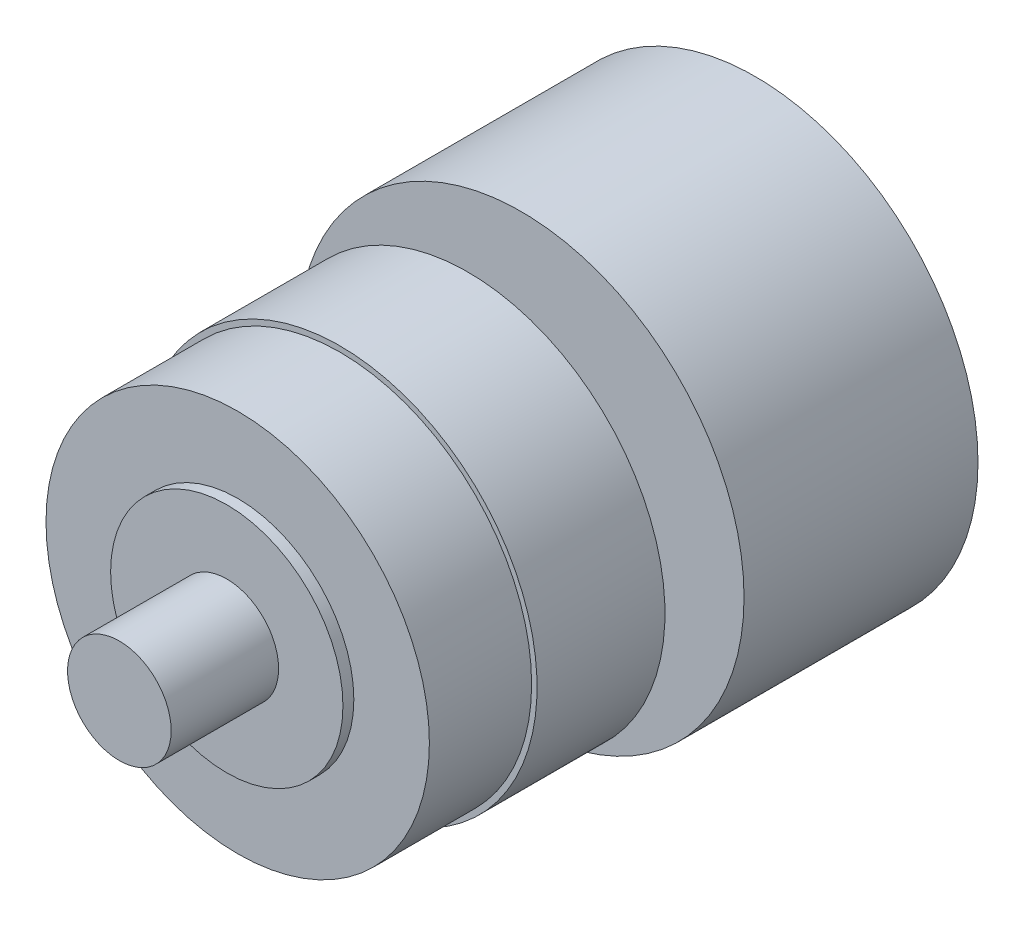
ISO-10303-21;
HEADER;
FILE_DESCRIPTION(('STEP AP214'),'2;1');
FILE_NAME('part.step','',(''),(''),'','','');
FILE_SCHEMA(('AUTOMOTIVE_DESIGN { 1 0 10303 214 1 1 1 1 }'));
ENDSEC;
DATA;
#1=APPLICATION_CONTEXT('core data for automotive mechanical design processes');
#2=APPLICATION_PROTOCOL_DEFINITION('international standard','automotive_design',2000,#1);
#3=PRODUCT_CONTEXT('',#1,'mechanical');
#4=PRODUCT('Part','Part','',(#3));
#5=PRODUCT_RELATED_PRODUCT_CATEGORY('part','',(#4));
#6=PRODUCT_DEFINITION_FORMATION('','',#4);
#7=PRODUCT_DEFINITION_CONTEXT('part definition',#1,'design');
#8=PRODUCT_DEFINITION('design','',#6,#7);
#9=PRODUCT_DEFINITION_SHAPE('','',#8);
#10=(LENGTH_UNIT() NAMED_UNIT(*) SI_UNIT(.MILLI.,.METRE.));
#11=(NAMED_UNIT(*) PLANE_ANGLE_UNIT() SI_UNIT($,.RADIAN.));
#12=(NAMED_UNIT(*) SI_UNIT($,.STERADIAN.) SOLID_ANGLE_UNIT());
#13=UNCERTAINTY_MEASURE_WITH_UNIT(LENGTH_MEASURE(1.E-05),#10,'distance_accuracy_value','');
#14=(GEOMETRIC_REPRESENTATION_CONTEXT(3) GLOBAL_UNCERTAINTY_ASSIGNED_CONTEXT((#13)) GLOBAL_UNIT_ASSIGNED_CONTEXT((#10,
#11,#12)) REPRESENTATION_CONTEXT('',''));
#15=CARTESIAN_POINT('',(0.,0.,0.));
#16=DIRECTION('',(0.,0.,1.));
#17=DIRECTION('',(1.,0.,0.));
#18=AXIS2_PLACEMENT_3D('',#15,#16,#17);
#19=CARTESIAN_POINT('',(-3.66617420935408,-6.34999999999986,-31.2674));
#20=DIRECTION('',(0.866025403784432,0.500000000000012,0.));
#21=DIRECTION('',(-0.500000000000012,0.866025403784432,0.));
#22=AXIS2_PLACEMENT_3D('',#19,#20,#21);
#23=PLANE('',#22);
#24=CARTESIAN_POINT('',(-3.66605873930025,-6.35019999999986,-30.2722361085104));
#25=CARTESIAN_POINT('',(-3.72909602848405,-6.24101621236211,-30.3352669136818));
#26=CARTESIAN_POINT('',(-3.79261785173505,-6.13099318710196,-30.3963633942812));
#27=CARTESIAN_POINT('',(-3.92072562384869,-5.90910401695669,-30.5140992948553));
#28=CARTESIAN_POINT('',(-3.98531213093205,-5.79723690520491,-30.5707362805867));
#29=CARTESIAN_POINT('',(-4.18141127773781,-5.45758321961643,-30.7335583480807));
#30=CARTESIAN_POINT('',(-4.31458398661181,-5.22692132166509,-30.8319599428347));
#31=CARTESIAN_POINT('',(-4.58313739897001,-4.76177316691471,-31.000465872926));
#32=CARTESIAN_POINT('',(-4.71844946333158,-4.52740579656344,-31.0709947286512));
#33=CARTESIAN_POINT('',(-4.92364212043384,-4.17200168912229,-31.1525792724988));
#34=CARTESIAN_POINT('',(-4.99234176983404,-4.05301040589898,-31.1757284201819));
#35=CARTESIAN_POINT('',(-5.13032275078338,-3.81402033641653,-31.2134332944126));
#36=CARTESIAN_POINT('',(-5.19960399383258,-3.6940217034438,-31.2279903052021));
#37=CARTESIAN_POINT('',(-5.36843302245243,-3.40160124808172,-31.2523972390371));
#38=CARTESIAN_POINT('',(-5.46816271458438,-3.22886435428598,-31.2575182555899));
#39=CARTESIAN_POINT('',(-5.6674423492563,-2.88370190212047,-31.2489227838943));
#40=CARTESIAN_POINT('',(-5.76699221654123,-2.71127647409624,-31.2351996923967));
#41=CARTESIAN_POINT('',(-5.96515340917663,-2.36805122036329,-31.1897249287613));
#42=CARTESIAN_POINT('',(-6.06376355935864,-2.19725343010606,-31.1579530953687));
#43=CARTESIAN_POINT('',(-6.25928899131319,-1.85859344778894,-31.0781081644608));
#44=CARTESIAN_POINT('',(-6.35620440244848,-1.69073103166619,-31.0300363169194));
#45=CARTESIAN_POINT('',(-6.52824622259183,-1.3927458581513,-30.9311380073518));
#46=CARTESIAN_POINT('',(-6.60375359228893,-1.26196325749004,-30.8829125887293));
#47=CARTESIAN_POINT('',(-6.75341289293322,-1.00274574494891,-30.7786904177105));
#48=CARTESIAN_POINT('',(-6.82756478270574,-0.874310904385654,-30.7226934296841));
#49=CARTESIAN_POINT('',(-6.97427956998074,-0.620193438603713,-30.6041833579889));
#50=CARTESIAN_POINT('',(-7.04684664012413,-0.494503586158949,-30.5416907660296));
#51=CARTESIAN_POINT('',(-7.19063704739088,-0.245451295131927,-30.4110099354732));
#52=CARTESIAN_POINT('',(-7.26186117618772,-0.122087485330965,-30.3428251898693));
#53=CARTESIAN_POINT('',(-7.33246388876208,0.000200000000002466,-30.2722361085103));
#54=B_SPLINE_CURVE_WITH_KNOTS('',3,(#24,#25,#26,#27,#28,#29,#30,#31,#32,#33,#34,#35,#36,#37,#38,
#39,#40,#41,#42,#43,#44,#45,#46,#47,#48,#49,#50,#51,#52,#53),.UNSPECIFIED.,.F.,.F.,(4,2,2,2,2,2,
2,2,2,2,2,2,2,2,4),(0.,0.422833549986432,0.845896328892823,1.6965893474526,2.53377423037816,
2.95154563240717,3.36925457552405,3.96689987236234,4.56475464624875,5.16327856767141,
5.7617566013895,6.23711762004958,6.71249305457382,7.18641189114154,7.66004201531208),.UNSPECIFIED.);
#55=CARTESIAN_POINT('',(-3.66617420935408,-6.34999999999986,-30.2723515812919));
#56=VERTEX_POINT('',#55);
#57=CARTESIAN_POINT('',(-7.33234841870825,0.,-30.2723515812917));
#58=VERTEX_POINT('',#57);
#59=EDGE_CURVE('E90',#56,#58,#54,.T.);
#60=ORIENTED_EDGE('',*,*,#59,.F.);
#61=DIRECTION('',(0.,0.,1.));
#62=VECTOR('',#61,1.);
#63=CARTESIAN_POINT('',(-3.66617420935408,-6.34999999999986,-31.2674));
#64=LINE('',#63,#62);
#65=CARTESIAN_POINT('',(-3.66617420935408,-6.34999999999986,-29.7434));
#66=VERTEX_POINT('',#65);
#67=EDGE_CURVE('E59',#56,#66,#64,.T.);
#68=ORIENTED_EDGE('',*,*,#67,.T.);
#69=DIRECTION('',(-0.500000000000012,0.866025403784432,0.));
#70=VECTOR('',#69,1.);
#71=CARTESIAN_POINT('',(-3.66617420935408,-6.34999999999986,-29.7434));
#72=LINE('',#71,#70);
#73=CARTESIAN_POINT('',(-7.33234841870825,0.,-29.7434));
#74=VERTEX_POINT('',#73);
#75=EDGE_CURVE('E98',#66,#74,#72,.T.);
#76=ORIENTED_EDGE('',*,*,#75,.T.);
#77=DIRECTION('',(0.,0.,1.));
#78=VECTOR('',#77,1.);
#79=CARTESIAN_POINT('',(-7.33234841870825,0.,-31.2674));
#80=LINE('',#79,#78);
#81=EDGE_CURVE('E97',#58,#74,#80,.T.);
#82=ORIENTED_EDGE('',*,*,#81,.F.);
#83=EDGE_LOOP('',(#60,#68,#76,#82));
#84=FACE_BOUND('',#83,.T.);
#85=ADVANCED_FACE('F36',(#84),#23,.F.);
#86=CARTESIAN_POINT('',(-7.33234841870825,0.,-31.2674));
#87=DIRECTION('',(0.866025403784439,-0.5,0.));
#88=DIRECTION('',(0.5,0.866025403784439,0.));
#89=AXIS2_PLACEMENT_3D('',#86,#87,#88);
#90=PLANE('',#89);
#91=CARTESIAN_POINT('',(-7.33246388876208,-0.000199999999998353,-30.2722361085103));
#92=CARTESIAN_POINT('',(-7.26942659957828,0.108983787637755,-30.3352669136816));
#93=CARTESIAN_POINT('',(-7.20590477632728,0.219006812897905,-30.3963633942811));
#94=CARTESIAN_POINT('',(-7.07779700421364,0.440895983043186,-30.5140992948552));
#95=CARTESIAN_POINT('',(-7.01321049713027,0.552763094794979,-30.5707362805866));
#96=CARTESIAN_POINT('',(-6.81711135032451,0.892416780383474,-30.7335583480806));
#97=CARTESIAN_POINT('',(-6.6839386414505,1.12307867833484,-30.8319599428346));
#98=CARTESIAN_POINT('',(-6.4153852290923,1.58822683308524,-31.0004658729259));
#99=CARTESIAN_POINT('',(-6.28007316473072,1.82259420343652,-31.0709947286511));
#100=CARTESIAN_POINT('',(-6.07488050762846,2.17799831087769,-31.1525792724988));
#101=CARTESIAN_POINT('',(-6.00618085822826,2.29698959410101,-31.1757284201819));
#102=CARTESIAN_POINT('',(-5.86819987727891,2.53597966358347,-31.2134332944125));
#103=CARTESIAN_POINT('',(-5.79891863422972,2.65597829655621,-31.2279903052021));
#104=CARTESIAN_POINT('',(-5.63008960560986,2.9483987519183,-31.252397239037));
#105=CARTESIAN_POINT('',(-5.53035991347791,3.12113564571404,-31.2575182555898));
#106=CARTESIAN_POINT('',(-5.33108027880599,3.46629809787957,-31.2489227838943));
#107=CARTESIAN_POINT('',(-5.23153041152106,3.6387235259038,-31.2351996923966));
#108=CARTESIAN_POINT('',(-5.03336921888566,3.98194877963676,-31.1897249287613));
#109=CARTESIAN_POINT('',(-4.93475906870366,4.15274656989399,-31.1579530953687));
#110=CARTESIAN_POINT('',(-4.73923363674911,4.49140655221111,-31.0781081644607));
#111=CARTESIAN_POINT('',(-4.64231822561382,4.65926896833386,-31.0300363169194));
#112=CARTESIAN_POINT('',(-4.47027640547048,4.95725414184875,-30.9311380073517));
#113=CARTESIAN_POINT('',(-4.39476903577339,5.08803674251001,-30.8829125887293));
#114=CARTESIAN_POINT('',(-4.24510973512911,5.34725425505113,-30.7786904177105));
#115=CARTESIAN_POINT('',(-4.17095784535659,5.47568909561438,-30.722693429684));
#116=CARTESIAN_POINT('',(-4.0242430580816,5.72980656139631,-30.6041833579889));
#117=CARTESIAN_POINT('',(-3.95167598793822,5.85549641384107,-30.5416907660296));
#118=CARTESIAN_POINT('',(-3.80788558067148,6.10454870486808,-30.4110099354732));
#119=CARTESIAN_POINT('',(-3.73666145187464,6.22791251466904,-30.3428251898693));
#120=CARTESIAN_POINT('',(-3.66605873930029,6.3502,-30.2722361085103));
#121=B_SPLINE_CURVE_WITH_KNOTS('',3,(#91,#92,#93,#94,#95,#96,#97,#98,#99,#100,#101,#102,#103,
#104,#105,#106,#107,#108,#109,#110,#111,#112,#113,#114,#115,#116,#117,#118,#119,#120),
.UNSPECIFIED.,.F.,.F.,(4,2,2,2,2,2,2,2,2,2,2,2,2,2,4),(0.,0.422833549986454,0.845896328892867,
1.69658934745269,2.5337742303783,2.95154563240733,3.36925457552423,3.96689987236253,
4.56475464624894,5.16327856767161,5.76175660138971,6.23711762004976,6.71249305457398,
7.18641189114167,7.66004201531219),.UNSPECIFIED.);
#122=CARTESIAN_POINT('',(-3.66617420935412,6.35,-30.2723515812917));
#123=VERTEX_POINT('',#122);
#124=EDGE_CURVE('E99',#58,#123,#121,.T.);
#125=ORIENTED_EDGE('',*,*,#124,.F.);
#126=ORIENTED_EDGE('',*,*,#81,.T.);
#127=DIRECTION('',(0.5,0.866025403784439,0.));
#128=VECTOR('',#127,1.);
#129=CARTESIAN_POINT('',(-7.33234841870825,0.,-29.7434));
#130=LINE('',#129,#128);
#131=CARTESIAN_POINT('',(-3.66617420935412,6.35,-29.7434));
#132=VERTEX_POINT('',#131);
#133=EDGE_CURVE('E470',#74,#132,#130,.T.);
#134=ORIENTED_EDGE('',*,*,#133,.T.);
#135=DIRECTION('',(0.,0.,1.));
#136=VECTOR('',#135,1.);
#137=CARTESIAN_POINT('',(-3.66617420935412,6.35,-31.2674));
#138=LINE('',#137,#136);
#139=EDGE_CURVE('E116',#123,#132,#138,.T.);
#140=ORIENTED_EDGE('',*,*,#139,.F.);
#141=EDGE_LOOP('',(#125,#126,#134,#140));
#142=FACE_BOUND('',#141,.T.);
#143=ADVANCED_FACE('F180',(#142),#90,.F.);
#144=CARTESIAN_POINT('',(-3.66617420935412,6.35,-31.2674));
#145=DIRECTION('',(0.,-1.,0.));
#146=DIRECTION('',(1.,0.,0.));
#147=AXIS2_PLACEMENT_3D('',#144,#145,#146);
#148=PLANE('',#147);
#149=CARTESIAN_POINT('',(-7.86102080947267,6.35,-27.4993475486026));
#150=CARTESIAN_POINT('',(-7.67188371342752,6.35,-27.6464458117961));
#151=CARTESIAN_POINT('',(-7.4817517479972,6.35,-27.7922845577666));
#152=CARTESIAN_POINT('',(-7.09908305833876,6.35,-28.0808608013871));
#153=CARTESIAN_POINT('',(-6.90654579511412,6.35,-28.2235975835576));
#154=CARTESIAN_POINT('',(-6.51724787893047,6.35,-28.5064020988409));
#155=CARTESIAN_POINT('',(-6.32046614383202,6.35,-28.6464409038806));
#156=CARTESIAN_POINT('',(-5.92367053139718,6.35,-28.9218456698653));
#157=CARTESIAN_POINT('',(-5.72365687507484,6.35,-29.0572119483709));
#158=CARTESIAN_POINT('',(-5.30623972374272,6.35,-29.3311146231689));
#159=CARTESIAN_POINT('',(-5.08857219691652,6.35,-29.4692506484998));
#160=CARTESIAN_POINT('',(-4.64811423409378,6.35,-29.7372414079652));
#161=CARTESIAN_POINT('',(-4.42532291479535,6.35,-29.8670946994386));
#162=CARTESIAN_POINT('',(-3.97450731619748,6.35,-30.1157775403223));
#163=CARTESIAN_POINT('',(-3.74650098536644,6.35,-30.2346393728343));
#164=CARTESIAN_POINT('',(-3.28391298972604,6.35,-30.4586757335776));
#165=CARTESIAN_POINT('',(-3.04933456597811,6.35,-30.5638568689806));
#166=CARTESIAN_POINT('',(-2.59892439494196,6.35,-30.7461813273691));
#167=CARTESIAN_POINT('',(-2.38383100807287,6.35,-30.8251302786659));
#168=CARTESIAN_POINT('',(-1.94798451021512,6.35,-30.965826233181));
#169=CARTESIAN_POINT('',(-1.72723105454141,6.35,-31.0275721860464));
#170=CARTESIAN_POINT('',(-1.28533870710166,6.35,-31.1294121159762));
#171=CARTESIAN_POINT('',(-1.06429531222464,6.35,-31.1699133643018));
#172=CARTESIAN_POINT('',(-0.619231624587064,6.35,-31.2283874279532));
#173=CARTESIAN_POINT('',(-0.395212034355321,6.35,-31.2463654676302));
#174=CARTESIAN_POINT('',(0.0425324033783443,6.35,-31.2581431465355));
#175=CARTESIAN_POINT('',(0.256226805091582,6.35,-31.2530785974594));
#176=CARTESIAN_POINT('',(0.682039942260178,6.35,-31.221709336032));
#177=CARTESIAN_POINT('',(0.894158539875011,6.35,-31.1954027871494));
#178=CARTESIAN_POINT('',(1.31888838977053,6.35,-31.1226217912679));
#179=CARTESIAN_POINT('',(1.53143613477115,6.35,-31.0757831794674));
#180=CARTESIAN_POINT('',(1.9518145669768,6.35,-30.9645988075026));
#181=CARTESIAN_POINT('',(2.15964543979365,6.35,-30.9002537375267));
#182=CARTESIAN_POINT('',(2.57809306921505,6.35,-30.7542169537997));
#183=CARTESIAN_POINT('',(2.78850689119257,6.35,-30.6719507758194));
#184=CARTESIAN_POINT('',(3.20394424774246,6.35,-30.4946763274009));
#185=CARTESIAN_POINT('',(3.40896534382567,6.35,-30.3996624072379));
#186=CARTESIAN_POINT('',(3.8145700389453,6.35,-30.19914338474));
#187=CARTESIAN_POINT('',(4.01513770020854,6.35,-30.0936063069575));
#188=CARTESIAN_POINT('',(4.4116855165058,6.35,-29.8743584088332));
#189=CARTESIAN_POINT('',(4.60766636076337,6.35,-29.7606488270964));
#190=CARTESIAN_POINT('',(4.98607816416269,6.35,-29.532411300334));
#191=CARTESIAN_POINT('',(5.16870096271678,6.35,-29.4181997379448));
#192=CARTESIAN_POINT('',(5.53080827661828,6.35,-29.1848912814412));
#193=CARTESIAN_POINT('',(5.71029255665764,6.35,-29.0657940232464));
#194=CARTESIAN_POINT('',(6.06509684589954,6.35,-28.8245472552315));
#195=CARTESIAN_POINT('',(6.2404386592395,6.35,-28.7024296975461));
#196=CARTESIAN_POINT('',(6.58871325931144,6.35,-28.4549028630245));
#197=CARTESIAN_POINT('',(6.76164669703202,6.35,-28.3294945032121));
#198=CARTESIAN_POINT('',(6.93356910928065,6.35,-28.20273847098));
#199=B_SPLINE_CURVE_WITH_KNOTS('',3,(#149,#150,#151,#152,#153,#154,#155,#156,#157,#158,#159,
#160,#161,#162,#163,#164,#165,#166,#167,#168,#169,#170,#171,#172,#173,#174,#175,#176,#177,#178,
#179,#180,#181,#182,#183,#184,#185,#186,#187,#188,#189,#190,#191,#192,#193,#194,#195,#196,#197,
#198),.UNSPECIFIED.,.F.,.F.,(4,2,2,2,2,2,2,2,2,2,2,2,2,2,2,2,2,2,2,2,2,2,2,2,4),(0.,
0.718828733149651,1.43782154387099,2.16233781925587,2.88680475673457,3.66005751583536,
4.43344459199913,5.20448276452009,5.97514716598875,6.66193487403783,7.34876450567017,
8.02189584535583,8.69487102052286,9.33504343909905,9.97527121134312,10.6273452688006,
11.2793936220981,11.9566508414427,12.6342092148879,13.3138930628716,13.9934741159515,
14.6395706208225,15.2857153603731,15.9267024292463,16.5675127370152),.UNSPECIFIED.);
#200=CARTESIAN_POINT('',(3.66617420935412,6.35,-30.2723515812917));
#201=VERTEX_POINT('',#200);
#202=EDGE_CURVE('E238',#123,#201,#199,.T.);
#203=ORIENTED_EDGE('',*,*,#202,.F.);
#204=ORIENTED_EDGE('',*,*,#139,.T.);
#205=DIRECTION('',(1.,0.,0.));
#206=VECTOR('',#205,1.);
#207=CARTESIAN_POINT('',(-3.66617420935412,6.35,-29.7434));
#208=LINE('',#207,#206);
#209=CARTESIAN_POINT('',(3.66617420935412,6.35,-29.7434));
#210=VERTEX_POINT('',#209);
#211=EDGE_CURVE('E471',#132,#210,#208,.T.);
#212=ORIENTED_EDGE('',*,*,#211,.T.);
#213=DIRECTION('',(0.,0.,1.));
#214=VECTOR('',#213,1.);
#215=CARTESIAN_POINT('',(3.66617420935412,6.35,-31.2674));
#216=LINE('',#215,#214);
#217=EDGE_CURVE('E114',#201,#210,#216,.T.);
#218=ORIENTED_EDGE('',*,*,#217,.F.);
#219=EDGE_LOOP('',(#203,#204,#212,#218));
#220=FACE_BOUND('',#219,.T.);
#221=ADVANCED_FACE('F185',(#220),#148,.F.);
#222=CARTESIAN_POINT('',(3.66617420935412,6.35,-31.2674));
#223=DIRECTION('',(-0.866025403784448,-0.499999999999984,0.));
#224=DIRECTION('',(0.499999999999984,-0.866025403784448,0.));
#225=AXIS2_PLACEMENT_3D('',#222,#223,#224);
#226=PLANE('',#225);
#227=CARTESIAN_POINT('',(3.66605873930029,6.3502,-30.2722361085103));
#228=CARTESIAN_POINT('',(3.72909602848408,6.24101621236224,-30.3352669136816));
#229=CARTESIAN_POINT('',(3.79261785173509,6.13099318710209,-30.3963633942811));
#230=CARTESIAN_POINT('',(3.92072562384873,5.9091040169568,-30.5140992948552));
#231=CARTESIAN_POINT('',(3.98531213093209,5.797236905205,-30.5707362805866));
#232=CARTESIAN_POINT('',(4.18141127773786,5.4575832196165,-30.7335583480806));
#233=CARTESIAN_POINT('',(4.31458398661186,5.22692132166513,-30.8319599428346));
#234=CARTESIAN_POINT('',(4.58313739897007,4.7617731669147,-31.000465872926));
#235=CARTESIAN_POINT('',(4.71844946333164,4.52740579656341,-31.0709947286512));
#236=CARTESIAN_POINT('',(4.9236421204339,4.17200168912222,-31.1525792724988));
#237=CARTESIAN_POINT('',(4.99234176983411,4.0530104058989,-31.1757284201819));
#238=CARTESIAN_POINT('',(5.13032275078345,3.81402033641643,-31.2134332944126));
#239=CARTESIAN_POINT('',(5.19960399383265,3.69402170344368,-31.2279903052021));
#240=CARTESIAN_POINT('',(5.3684330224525,3.40160124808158,-31.2523972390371));
#241=CARTESIAN_POINT('',(5.46816271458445,3.22886435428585,-31.2575182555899));
#242=CARTESIAN_POINT('',(5.66744234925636,2.88370190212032,-31.2489227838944));
#243=CARTESIAN_POINT('',(5.76699221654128,2.71127647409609,-31.2351996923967));
#244=CARTESIAN_POINT('',(5.96515340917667,2.36805122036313,-31.1897249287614));
#245=CARTESIAN_POINT('',(6.06376355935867,2.1972534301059,-31.1579530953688));
#246=CARTESIAN_POINT('',(6.25928899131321,1.85859344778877,-31.0781081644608));
#247=CARTESIAN_POINT('',(6.3562044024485,1.69073103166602,-31.0300363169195));
#248=CARTESIAN_POINT('',(6.52824622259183,1.39274585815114,-30.9311380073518));
#249=CARTESIAN_POINT('',(6.60375359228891,1.2619632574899,-30.8829125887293));
#250=CARTESIAN_POINT('',(6.75341289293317,1.0027457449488,-30.7786904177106));
#251=CARTESIAN_POINT('',(6.82756478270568,0.874310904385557,-30.7226934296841));
#252=CARTESIAN_POINT('',(6.97427956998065,0.620193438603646,-30.604183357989));
#253=CARTESIAN_POINT('',(7.04684664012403,0.494503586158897,-30.5416907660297));
#254=CARTESIAN_POINT('',(7.19063704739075,0.245451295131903,-30.4110099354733));
#255=CARTESIAN_POINT('',(7.26186117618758,0.122087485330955,-30.3428251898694));
#256=CARTESIAN_POINT('',(7.33246388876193,-0.000200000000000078,-30.2722361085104));
#257=B_SPLINE_CURVE_WITH_KNOTS('',3,(#227,#228,#229,#230,#231,#232,#233,#234,#235,#236,#237,
#238,#239,#240,#241,#242,#243,#244,#245,#246,#247,#248,#249,#250,#251,#252,#253,#254,#255,#256),
.UNSPECIFIED.,.F.,.F.,(4,2,2,2,2,2,2,2,2,2,2,2,2,2,4),(0.,0.422833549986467,0.845896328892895,
1.69658934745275,2.53377423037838,2.95154563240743,3.36925457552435,3.96689987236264,
4.56475464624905,5.16327856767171,5.7617566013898,6.23711762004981,6.71249305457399,
7.18641189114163,7.66004201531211),.UNSPECIFIED.);
#258=CARTESIAN_POINT('',(7.33234841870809,0.,-30.2723515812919));
#259=VERTEX_POINT('',#258);
#260=EDGE_CURVE('E232',#201,#259,#257,.T.);
#261=ORIENTED_EDGE('',*,*,#260,.F.);
#262=ORIENTED_EDGE('',*,*,#217,.T.);
#263=DIRECTION('',(0.499999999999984,-0.866025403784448,0.));
#264=VECTOR('',#263,1.);
#265=CARTESIAN_POINT('',(3.66617420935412,6.35,-29.7434));
#266=LINE('',#265,#264);
#267=CARTESIAN_POINT('',(7.33234841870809,0.,-29.7434));
#268=VERTEX_POINT('',#267);
#269=EDGE_CURVE('E474',#210,#268,#266,.T.);
#270=ORIENTED_EDGE('',*,*,#269,.T.);
#271=DIRECTION('',(0.,0.,1.));
#272=VECTOR('',#271,1.);
#273=CARTESIAN_POINT('',(7.33234841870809,0.,-31.2674));
#274=LINE('',#273,#272);
#275=EDGE_CURVE('E107',#259,#268,#274,.T.);
#276=ORIENTED_EDGE('',*,*,#275,.F.);
#277=EDGE_LOOP('',(#261,#262,#270,#276));
#278=FACE_BOUND('',#277,.T.);
#279=ADVANCED_FACE('F245',(#278),#226,.F.);
#280=CARTESIAN_POINT('',(7.33234841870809,0.,-31.2674));
#281=DIRECTION('',(-0.866025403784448,0.499999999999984,0.));
#282=DIRECTION('',(-0.499999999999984,-0.866025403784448,0.));
#283=AXIS2_PLACEMENT_3D('',#280,#281,#282);
#284=PLANE('',#283);
#285=CARTESIAN_POINT('',(7.33246388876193,0.000200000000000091,-30.2722361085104));
#286=CARTESIAN_POINT('',(7.26942659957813,-0.10898378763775,-30.3352669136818));
#287=CARTESIAN_POINT('',(7.20590477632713,-0.219006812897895,-30.3963633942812));
#288=CARTESIAN_POINT('',(7.0777970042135,-0.440895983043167,-30.5140992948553));
#289=CARTESIAN_POINT('',(7.01321049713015,-0.552763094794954,-30.5707362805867));
#290=CARTESIAN_POINT('',(6.8171113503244,-0.892416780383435,-30.7335583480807));
#291=CARTESIAN_POINT('',(6.6839386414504,-1.12307867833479,-30.8319599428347));
#292=CARTESIAN_POINT('',(6.41538522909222,-1.58822683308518,-31.000465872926));
#293=CARTESIAN_POINT('',(6.28007316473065,-1.82259420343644,-31.0709947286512));
#294=CARTESIAN_POINT('',(6.07488050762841,-2.1779983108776,-31.1525792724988));
#295=CARTESIAN_POINT('',(6.00618085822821,-2.29698959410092,-31.1757284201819));
#296=CARTESIAN_POINT('',(5.86819987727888,-2.53597966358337,-31.2134332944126));
#297=CARTESIAN_POINT('',(5.79891863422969,-2.6559782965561,-31.2279903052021));
#298=CARTESIAN_POINT('',(5.63008960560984,-2.94839875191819,-31.2523972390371));
#299=CARTESIAN_POINT('',(5.53035991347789,-3.12113564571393,-31.2575182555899));
#300=CARTESIAN_POINT('',(5.33108027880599,-3.46629809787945,-31.2489227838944));
#301=CARTESIAN_POINT('',(5.23153041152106,-3.63872352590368,-31.2351996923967));
#302=CARTESIAN_POINT('',(5.03336921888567,-3.98194877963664,-31.1897249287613));
#303=CARTESIAN_POINT('',(4.93475906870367,-4.15274656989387,-31.1579530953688));
#304=CARTESIAN_POINT('',(4.73923363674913,-4.491406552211,-31.0781081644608));
#305=CARTESIAN_POINT('',(4.64231822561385,-4.65926896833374,-31.0300363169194));
#306=CARTESIAN_POINT('',(4.47027640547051,-4.95725414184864,-30.9311380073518));
#307=CARTESIAN_POINT('',(4.39476903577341,-5.08803674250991,-30.8829125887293));
#308=CARTESIAN_POINT('',(4.24510973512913,-5.34725425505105,-30.7786904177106));
#309=CARTESIAN_POINT('',(4.1709578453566,-5.47568909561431,-30.7226934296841));
#310=CARTESIAN_POINT('',(4.02424305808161,-5.72980656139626,-30.6041833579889));
#311=CARTESIAN_POINT('',(3.95167598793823,-5.85549641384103,-30.5416907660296));
#312=CARTESIAN_POINT('',(3.80788558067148,-6.10454870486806,-30.4110099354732));
#313=CARTESIAN_POINT('',(3.73666145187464,-6.22791251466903,-30.3428251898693));
#314=CARTESIAN_POINT('',(3.66605873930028,-6.3502,-30.2722361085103));
#315=B_SPLINE_CURVE_WITH_KNOTS('',3,(#285,#286,#287,#288,#289,#290,#291,#292,#293,#294,#295,
#296,#297,#298,#299,#300,#301,#302,#303,#304,#305,#306,#307,#308,#309,#310,#311,#312,#313,#314),
.UNSPECIFIED.,.F.,.F.,(4,2,2,2,2,2,2,2,2,2,2,2,2,2,4),(0.,0.422833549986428,0.845896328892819,
1.6965893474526,2.53377423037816,2.95154563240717,3.36925457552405,3.96689987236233,
4.56475464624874,5.16327856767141,5.76175660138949,6.23711762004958,6.71249305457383,
7.18641189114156,7.66004201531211),.UNSPECIFIED.);
#316=CARTESIAN_POINT('',(3.66617420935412,-6.35,-30.2723515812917));
#317=VERTEX_POINT('',#316);
#318=EDGE_CURVE('E51',#259,#317,#315,.T.);
#319=ORIENTED_EDGE('',*,*,#318,.F.);
#320=ORIENTED_EDGE('',*,*,#275,.T.);
#321=DIRECTION('',(-0.499999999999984,-0.866025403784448,0.));
#322=VECTOR('',#321,1.);
#323=CARTESIAN_POINT('',(7.33234841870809,0.,-29.7434));
#324=LINE('',#323,#322);
#325=CARTESIAN_POINT('',(3.66617420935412,-6.35,-29.7434));
#326=VERTEX_POINT('',#325);
#327=EDGE_CURVE('E109',#268,#326,#324,.T.);
#328=ORIENTED_EDGE('',*,*,#327,.T.);
#329=DIRECTION('',(0.,0.,1.));
#330=VECTOR('',#329,1.);
#331=CARTESIAN_POINT('',(3.66617420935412,-6.35,-31.2674));
#332=LINE('',#331,#330);
#333=EDGE_CURVE('E105',#317,#326,#332,.T.);
#334=ORIENTED_EDGE('',*,*,#333,.F.);
#335=EDGE_LOOP('',(#319,#320,#328,#334));
#336=FACE_BOUND('',#335,.T.);
#337=ADVANCED_FACE('F249',(#336),#284,.F.);
#338=CARTESIAN_POINT('',(3.66617420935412,-6.35,-31.2674));
#339=DIRECTION('',(0.,1.,0.));
#340=DIRECTION('',(-1.,0.,0.));
#341=AXIS2_PLACEMENT_3D('',#338,#339,#340);
#342=PLANE('',#341);
#343=CARTESIAN_POINT('',(-7.86102080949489,-6.34999999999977,-27.4993475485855));
#344=CARTESIAN_POINT('',(-7.67188371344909,-6.34999999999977,-27.6464458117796));
#345=CARTESIAN_POINT('',(-7.48175174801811,-6.34999999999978,-27.7922845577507));
#346=CARTESIAN_POINT('',(-7.09908305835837,-6.34999999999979,-28.0808608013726));
#347=CARTESIAN_POINT('',(-6.90654579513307,-6.34999999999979,-28.2235975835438));
#348=CARTESIAN_POINT('',(-6.51724787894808,-6.3499999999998,-28.5064020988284));
#349=CARTESIAN_POINT('',(-6.32046614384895,-6.3499999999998,-28.6464409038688));
#350=CARTESIAN_POINT('',(-5.92367053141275,-6.34999999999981,-28.9218456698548));
#351=CARTESIAN_POINT('',(-5.72365687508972,-6.34999999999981,-29.0572119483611));
#352=CARTESIAN_POINT('',(-5.3062397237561,-6.34999999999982,-29.3311146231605));
#353=CARTESIAN_POINT('',(-5.0885721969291,-6.34999999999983,-29.4692506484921));
#354=CARTESIAN_POINT('',(-4.64811423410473,-6.34999999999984,-29.7372414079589));
#355=CARTESIAN_POINT('',(-4.42532291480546,-6.34999999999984,-29.867094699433));
#356=CARTESIAN_POINT('',(-3.9745073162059,-6.34999999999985,-30.115777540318));
#357=CARTESIAN_POINT('',(-3.746500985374,-6.34999999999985,-30.2346393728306));
#358=CARTESIAN_POINT('',(-3.28391298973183,-6.34999999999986,-30.4586757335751));
#359=CARTESIAN_POINT('',(-3.049334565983,-6.34999999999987,-30.5638568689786));
#360=CARTESIAN_POINT('',(-2.59892439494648,-6.34999999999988,-30.7461813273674));
#361=CARTESIAN_POINT('',(-2.38383100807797,-6.34999999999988,-30.8251302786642));
#362=CARTESIAN_POINT('',(-1.94798451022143,-6.34999999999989,-30.9658262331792));
#363=CARTESIAN_POINT('',(-1.72723105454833,-6.34999999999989,-31.0275721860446));
#364=CARTESIAN_POINT('',(-1.28533870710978,-6.3499999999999,-31.1294121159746));
#365=CARTESIAN_POINT('',(-1.06429531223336,-6.34999999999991,-31.1699133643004));
#366=CARTESIAN_POINT('',(-0.619231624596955,-6.34999999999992,-31.2283874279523));
#367=CARTESIAN_POINT('',(-0.395212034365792,-6.34999999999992,-31.2463654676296));
#368=CARTESIAN_POINT('',(0.042532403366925,-6.34999999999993,-31.2581431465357));
#369=CARTESIAN_POINT('',(0.256226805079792,-6.34999999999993,-31.25307859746));
#370=CARTESIAN_POINT('',(0.682039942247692,-6.34999999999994,-31.2217093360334));
#371=CARTESIAN_POINT('',(0.894158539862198,-6.34999999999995,-31.1954027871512));
#372=CARTESIAN_POINT('',(1.31888838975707,-6.34999999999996,-31.1226217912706));
#373=CARTESIAN_POINT('',(1.53143613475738,-6.34999999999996,-31.0757831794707));
#374=CARTESIAN_POINT('',(1.95181456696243,-6.34999999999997,-30.9645988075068));
#375=CARTESIAN_POINT('',(2.159645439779,-6.34999999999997,-30.9002537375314));
#376=CARTESIAN_POINT('',(2.57809306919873,-6.34999999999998,-30.7542169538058));
#377=CARTESIAN_POINT('',(2.78850689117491,-6.34999999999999,-30.6719507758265));
#378=CARTESIAN_POINT('',(3.20394424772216,-6.34999999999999,-30.49467632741));
#379=CARTESIAN_POINT('',(3.40896534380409,-6.35,-30.3996624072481));
#380=CARTESIAN_POINT('',(3.8145700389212,-6.35000000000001,-30.1991433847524));
#381=CARTESIAN_POINT('',(4.0151377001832,-6.35000000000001,-30.093606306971));
#382=CARTESIAN_POINT('',(4.41168551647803,-6.35000000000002,-29.874358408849));
#383=CARTESIAN_POINT('',(4.60766636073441,-6.35000000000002,-29.7606488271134));
#384=CARTESIAN_POINT('',(4.98607816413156,-6.35000000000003,-29.5324113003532));
#385=CARTESIAN_POINT('',(5.16870096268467,-6.35000000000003,-29.418199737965));
#386=CARTESIAN_POINT('',(5.53080827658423,-6.35000000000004,-29.1848912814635));
#387=CARTESIAN_POINT('',(5.71029255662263,-6.35000000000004,-29.0657940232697));
#388=CARTESIAN_POINT('',(6.06509684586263,-6.35000000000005,-28.8245472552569));
#389=CARTESIAN_POINT('',(6.24043865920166,-6.35000000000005,-28.7024296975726));
#390=CARTESIAN_POINT('',(6.58871325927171,-6.35000000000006,-28.454902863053));
#391=CARTESIAN_POINT('',(6.76164669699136,-6.35000000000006,-28.3294945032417));
#392=CARTESIAN_POINT('',(6.93356910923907,-6.35000000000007,-28.2027384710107));
#393=B_SPLINE_CURVE_WITH_KNOTS('',3,(#343,#344,#345,#346,#347,#348,#349,#350,#351,#352,#353,
#354,#355,#356,#357,#358,#359,#360,#361,#362,#363,#364,#365,#366,#367,#368,#369,#370,#371,#372,
#373,#374,#375,#376,#377,#378,#379,#380,#381,#382,#383,#384,#385,#386,#387,#388,#389,#390,#391,
#392),.UNSPECIFIED.,.F.,.F.,(4,2,2,2,2,2,2,2,2,2,2,2,2,2,2,2,2,2,2,2,2,2,2,2,4),(0.,
0.718828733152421,1.43782154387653,2.16233781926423,2.88680475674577,3.66005751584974,
4.43344459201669,5.20448276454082,5.97514716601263,6.66193487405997,7.34876450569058,
8.02189584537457,8.69487102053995,9.33504343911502,9.97527121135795,10.6273452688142,
11.2793936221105,11.9566508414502,12.6342092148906,13.3138930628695,13.9934741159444,
14.6395706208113,15.2857153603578,15.9267024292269,16.5675127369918),.UNSPECIFIED.);
#394=EDGE_CURVE('E88',#317,#56,#393,.F.);
#395=ORIENTED_EDGE('',*,*,#394,.F.);
#396=ORIENTED_EDGE('',*,*,#333,.T.);
#397=DIRECTION('',(-1.,0.,0.));
#398=VECTOR('',#397,1.);
#399=CARTESIAN_POINT('',(3.66617420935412,-6.35,-29.7434));
#400=LINE('',#399,#398);
#401=EDGE_CURVE('E103',#326,#66,#400,.T.);
#402=ORIENTED_EDGE('',*,*,#401,.T.);
#403=ORIENTED_EDGE('',*,*,#67,.F.);
#404=EDGE_LOOP('',(#395,#396,#402,#403));
#405=FACE_BOUND('',#404,.T.);
#406=ADVANCED_FACE('F101',(#405),#342,.F.);
#407=CARTESIAN_POINT('',(0.,0.,-29.6164));
#408=DIRECTION('',(0.,0.,-1.));
#409=DIRECTION('',(-1.,0.,0.));
#410=AXIS2_PLACEMENT_3D('',#407,#408,#409);
#411=PLANE('',#410);
#412=CARTESIAN_POINT('',(0.,0.,-29.6164));
#413=DIRECTION('',(0.,0.,-1.));
#414=DIRECTION('',(-1.,0.,0.));
#415=AXIS2_PLACEMENT_3D('',#412,#413,#414);
#416=CIRCLE('',#415,10.3759000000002);
#417=CARTESIAN_POINT('',(-10.3759000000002,0.,-29.6164));
#418=VERTEX_POINT('',#417);
#419=EDGE_CURVE('E126',#418,#418,#416,.T.);
#420=ORIENTED_EDGE('',*,*,#419,.T.);
#421=EDGE_LOOP('',(#420));
#422=FACE_BOUND('',#421,.T.);
#423=CARTESIAN_POINT('',(0.,0.,-29.6164));
#424=DIRECTION('',(0.,0.,-1.));
#425=DIRECTION('',(-1.,0.,0.));
#426=AXIS2_PLACEMENT_3D('',#423,#424,#425);
#427=CIRCLE('',#426,5.07999999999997);
#428=CARTESIAN_POINT('',(-5.07999999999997,0.,-29.6164));
#429=VERTEX_POINT('',#428);
#430=EDGE_CURVE('E119',#429,#429,#427,.T.);
#431=ORIENTED_EDGE('',*,*,#430,.F.);
#432=EDGE_LOOP('',(#431));
#433=FACE_BOUND('',#432,.T.);
#434=ADVANCED_FACE('F256',(#422,#433),#411,.T.);
#435=CARTESIAN_POINT('',(0.,0.,-16.2306));
#436=DIRECTION('',(0.,0.,-1.));
#437=DIRECTION('',(-1.,0.,0.));
#438=AXIS2_PLACEMENT_3D('',#435,#436,#437);
#439=PLANE('',#438);
#440=CARTESIAN_POINT('',(0.,0.,-16.2306));
#441=DIRECTION('',(0.,0.,-1.));
#442=DIRECTION('',(-1.,0.,0.));
#443=AXIS2_PLACEMENT_3D('',#440,#441,#442);
#444=CIRCLE('',#443,9.18209999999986);
#445=CARTESIAN_POINT('',(-9.18209999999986,0.,-16.2306));
#446=VERTEX_POINT('',#445);
#447=EDGE_CURVE('E141',#446,#446,#444,.T.);
#448=ORIENTED_EDGE('',*,*,#447,.T.);
#449=EDGE_LOOP('',(#448));
#450=FACE_BOUND('',#449,.T.);
#451=CARTESIAN_POINT('',(0.,0.,-16.2306));
#452=DIRECTION('',(0.,0.,-1.));
#453=DIRECTION('',(-1.,0.,0.));
#454=AXIS2_PLACEMENT_3D('',#451,#452,#453);
#455=CIRCLE('',#454,6.35);
#456=CARTESIAN_POINT('',(-6.35,0.,-16.2306));
#457=VERTEX_POINT('',#456);
#458=EDGE_CURVE('E134',#457,#457,#455,.T.);
#459=ORIENTED_EDGE('',*,*,#458,.F.);
#460=EDGE_LOOP('',(#459));
#461=FACE_BOUND('',#460,.T.);
#462=ADVANCED_FACE('F271',(#450,#461),#439,.T.);
#463=CARTESIAN_POINT('',(0.,0.,-5.0038));
#464=DIRECTION('',(0.,0.,1.));
#465=DIRECTION('',(1.,0.,0.));
#466=AXIS2_PLACEMENT_3D('',#463,#464,#465);
#467=CYLINDRICAL_SURFACE('',#466,2.413);
#468=CARTESIAN_POINT('',(0.,0.,-5.0038));
#469=DIRECTION('',(0.,0.,-1.));
#470=DIRECTION('',(-1.,0.,0.));
#471=AXIS2_PLACEMENT_3D('',#468,#469,#470);
#472=CIRCLE('',#471,2.413);
#473=CARTESIAN_POINT('',(-2.413,0.,-5.0038));
#474=VERTEX_POINT('',#473);
#475=EDGE_CURVE('E44',#474,#474,#472,.F.);
#476=ORIENTED_EDGE('',*,*,#475,.T.);
#477=EDGE_LOOP('',(#476));
#478=FACE_BOUND('',#477,.T.);
#479=CARTESIAN_POINT('',(0.,0.,0.));
#480=DIRECTION('',(0.,0.,1.));
#481=DIRECTION('',(1.,0.,0.));
#482=AXIS2_PLACEMENT_3D('',#479,#480,#481);
#483=CIRCLE('',#482,2.413);
#484=CARTESIAN_POINT('',(2.413,0.,0.));
#485=VERTEX_POINT('',#484);
#486=EDGE_CURVE('E12',#485,#485,#483,.T.);
#487=ORIENTED_EDGE('',*,*,#486,.F.);
#488=EDGE_LOOP('',(#487));
#489=FACE_BOUND('',#488,.T.);
#490=ADVANCED_FACE('F38',(#478,#489),#467,.T.);
#491=CARTESIAN_POINT('',(0.,0.,0.));
#492=DIRECTION('',(0.,0.,1.));
#493=DIRECTION('',(1.,0.,0.));
#494=AXIS2_PLACEMENT_3D('',#491,#492,#493);
#495=PLANE('',#494);
#496=ORIENTED_EDGE('',*,*,#486,.T.);
#497=EDGE_LOOP('',(#496));
#498=FACE_BOUND('',#497,.T.);
#499=ADVANCED_FACE('F171',(#498),#495,.T.);
#500=CARTESIAN_POINT('',(0.,0.,-5.5118));
#501=DIRECTION('',(0.,0.,1.));
#502=DIRECTION('',(1.,0.,0.));
#503=AXIS2_PLACEMENT_3D('',#500,#501,#502);
#504=CYLINDRICAL_SURFACE('',#503,5.41020000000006);
#505=CARTESIAN_POINT('',(0.,0.,-5.5118));
#506=DIRECTION('',(0.,0.,-1.));
#507=DIRECTION('',(-1.,0.,0.));
#508=AXIS2_PLACEMENT_3D('',#505,#506,#507);
#509=CIRCLE('',#508,5.41020000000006);
#510=CARTESIAN_POINT('',(-5.41020000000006,0.,-5.5118));
#511=VERTEX_POINT('',#510);
#512=EDGE_CURVE('E153',#511,#511,#509,.T.);
#513=ORIENTED_EDGE('',*,*,#512,.F.);
#514=EDGE_LOOP('',(#513));
#515=FACE_BOUND('',#514,.T.);
#516=CARTESIAN_POINT('',(0.,0.,-5.0038));
#517=DIRECTION('',(0.,0.,-1.));
#518=DIRECTION('',(-1.,0.,0.));
#519=AXIS2_PLACEMENT_3D('',#516,#517,#518);
#520=CIRCLE('',#519,5.41020000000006);
#521=CARTESIAN_POINT('',(-5.41020000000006,0.,-5.0038));
#522=VERTEX_POINT('',#521);
#523=EDGE_CURVE('E150',#522,#522,#520,.T.);
#524=ORIENTED_EDGE('',*,*,#523,.T.);
#525=EDGE_LOOP('',(#524));
#526=FACE_BOUND('',#525,.T.);
#527=ADVANCED_FACE('F166',(#515,#526),#504,.T.);
#528=CARTESIAN_POINT('',(0.,0.,-5.0038));
#529=DIRECTION('',(0.,0.,-1.));
#530=DIRECTION('',(-1.,0.,0.));
#531=AXIS2_PLACEMENT_3D('',#528,#529,#530);
#532=PLANE('',#531);
#533=ORIENTED_EDGE('',*,*,#475,.F.);
#534=EDGE_LOOP('',(#533));
#535=FACE_BOUND('',#534,.T.);
#536=ORIENTED_EDGE('',*,*,#523,.F.);
#537=EDGE_LOOP('',(#536));
#538=FACE_BOUND('',#537,.T.);
#539=ADVANCED_FACE('F162',(#535,#538),#532,.F.);
#540=CARTESIAN_POINT('',(0.,0.,-5.5118));
#541=DIRECTION('',(0.,0.,-1.));
#542=DIRECTION('',(-1.,0.,0.));
#543=AXIS2_PLACEMENT_3D('',#540,#541,#542);
#544=PLANE('',#543);
#545=CARTESIAN_POINT('',(0.,0.,-5.5118));
#546=DIRECTION('',(0.,0.,-1.));
#547=DIRECTION('',(-1.,0.,0.));
#548=AXIS2_PLACEMENT_3D('',#545,#546,#547);
#549=CIRCLE('',#548,8.92810000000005);
#550=CARTESIAN_POINT('',(8.92810000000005,0.,-5.5118));
#551=VERTEX_POINT('',#550);
#552=EDGE_CURVE('E144',#551,#551,#549,.T.);
#553=ORIENTED_EDGE('',*,*,#552,.F.);
#554=EDGE_LOOP('',(#553));
#555=FACE_BOUND('',#554,.T.);
#556=ORIENTED_EDGE('',*,*,#512,.T.);
#557=EDGE_LOOP('',(#556));
#558=FACE_BOUND('',#557,.T.);
#559=ADVANCED_FACE('F165',(#555,#558),#544,.F.);
#560=CARTESIAN_POINT('',(0.,0.,-10.2743));
#561=DIRECTION('',(0.,0.,1.));
#562=DIRECTION('',(1.,0.,0.));
#563=AXIS2_PLACEMENT_3D('',#560,#561,#562);
#564=CYLINDRICAL_SURFACE('',#563,8.92810000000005);
#565=CARTESIAN_POINT('',(0.,0.,-10.2743));
#566=DIRECTION('',(0.,0.,-1.));
#567=DIRECTION('',(-1.,0.,0.));
#568=AXIS2_PLACEMENT_3D('',#565,#566,#567);
#569=CIRCLE('',#568,8.92810000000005);
#570=CARTESIAN_POINT('',(8.92810000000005,0.,-10.2743));
#571=VERTEX_POINT('',#570);
#572=EDGE_CURVE('E147',#571,#571,#569,.T.);
#573=CARTESIAN_POINT('',(8.92810000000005,0.,-10.2743));
#574=CARTESIAN_POINT('',(8.92810000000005,0.,-10.224690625));
#575=CARTESIAN_POINT('',(8.92810000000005,0.,-10.17508125));
#576=CARTESIAN_POINT('',(8.92810000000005,0.,-10.0758625));
#577=CARTESIAN_POINT('',(8.92810000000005,0.,-10.026253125));
#578=CARTESIAN_POINT('',(8.92810000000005,0.,-9.927034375));
#579=CARTESIAN_POINT('',(8.92810000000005,0.,-9.877425));
#580=CARTESIAN_POINT('',(8.92810000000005,0.,-9.77820625));
#581=CARTESIAN_POINT('',(8.92810000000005,0.,-9.728596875));
#582=CARTESIAN_POINT('',(8.92810000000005,0.,-9.629378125));
#583=CARTESIAN_POINT('',(8.92810000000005,0.,-9.57976875));
#584=CARTESIAN_POINT('',(8.92810000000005,0.,-9.48055));
#585=CARTESIAN_POINT('',(8.92810000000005,0.,-9.430940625));
#586=CARTESIAN_POINT('',(8.92810000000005,0.,-9.331721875));
#587=CARTESIAN_POINT('',(8.92810000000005,0.,-9.2821125));
#588=CARTESIAN_POINT('',(8.92810000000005,0.,-9.18289375));
#589=CARTESIAN_POINT('',(8.92810000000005,0.,-9.133284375));
#590=CARTESIAN_POINT('',(8.92810000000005,0.,-9.034065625));
#591=CARTESIAN_POINT('',(8.92810000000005,0.,-8.98445625));
#592=CARTESIAN_POINT('',(8.92810000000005,0.,-8.8852375));
#593=CARTESIAN_POINT('',(8.92810000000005,0.,-8.835628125));
#594=CARTESIAN_POINT('',(8.92810000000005,0.,-8.736409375));
#595=CARTESIAN_POINT('',(8.92810000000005,0.,-8.6868));
#596=CARTESIAN_POINT('',(8.92810000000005,0.,-8.58758125));
#597=CARTESIAN_POINT('',(8.92810000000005,0.,-8.537971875));
#598=CARTESIAN_POINT('',(8.92810000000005,0.,-8.438753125));
#599=CARTESIAN_POINT('',(8.92810000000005,0.,-8.38914375));
#600=CARTESIAN_POINT('',(8.92810000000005,0.,-8.289925));
#601=CARTESIAN_POINT('',(8.92810000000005,0.,-8.240315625));
#602=CARTESIAN_POINT('',(8.92810000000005,0.,-8.141096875));
#603=CARTESIAN_POINT('',(8.92810000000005,0.,-8.0914875));
#604=CARTESIAN_POINT('',(8.92810000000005,0.,-7.99226875));
#605=CARTESIAN_POINT('',(8.92810000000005,0.,-7.942659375));
#606=CARTESIAN_POINT('',(8.92810000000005,0.,-7.843440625));
#607=CARTESIAN_POINT('',(8.92810000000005,0.,-7.79383125));
#608=CARTESIAN_POINT('',(8.92810000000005,0.,-7.6946125));
#609=CARTESIAN_POINT('',(8.92810000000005,0.,-7.645003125));
#610=CARTESIAN_POINT('',(8.92810000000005,0.,-7.545784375));
#611=CARTESIAN_POINT('',(8.92810000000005,0.,-7.496175));
#612=CARTESIAN_POINT('',(8.92810000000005,0.,-7.39695625));
#613=CARTESIAN_POINT('',(8.92810000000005,0.,-7.347346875));
#614=CARTESIAN_POINT('',(8.92810000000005,0.,-7.248128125));
#615=CARTESIAN_POINT('',(8.92810000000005,0.,-7.19851875));
#616=CARTESIAN_POINT('',(8.92810000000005,0.,-7.0993));
#617=CARTESIAN_POINT('',(8.92810000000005,0.,-7.049690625));
#618=CARTESIAN_POINT('',(8.92810000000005,0.,-6.950471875));
#619=CARTESIAN_POINT('',(8.92810000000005,0.,-6.9008625));
#620=CARTESIAN_POINT('',(8.92810000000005,0.,-6.80164375));
#621=CARTESIAN_POINT('',(8.92810000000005,0.,-6.752034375));
#622=CARTESIAN_POINT('',(8.92810000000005,0.,-6.652815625));
#623=CARTESIAN_POINT('',(8.92810000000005,0.,-6.60320625));
#624=CARTESIAN_POINT('',(8.92810000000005,0.,-6.5039875));
#625=CARTESIAN_POINT('',(8.92810000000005,0.,-6.454378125));
#626=CARTESIAN_POINT('',(8.92810000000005,0.,-6.355159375));
#627=CARTESIAN_POINT('',(8.92810000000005,0.,-6.30555));
#628=CARTESIAN_POINT('',(8.92810000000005,0.,-6.20633125));
#629=CARTESIAN_POINT('',(8.92810000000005,0.,-6.156721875));
#630=CARTESIAN_POINT('',(8.92810000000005,0.,-6.057503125));
#631=CARTESIAN_POINT('',(8.92810000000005,0.,-6.00789375));
#632=CARTESIAN_POINT('',(8.92810000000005,0.,-5.908675));
#633=CARTESIAN_POINT('',(8.92810000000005,0.,-5.859065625));
#634=CARTESIAN_POINT('',(8.92810000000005,0.,-5.759846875));
#635=CARTESIAN_POINT('',(8.92810000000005,0.,-5.7102375));
#636=CARTESIAN_POINT('',(8.92810000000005,0.,-5.61101875));
#637=CARTESIAN_POINT('',(8.92810000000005,0.,-5.561409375));
#638=CARTESIAN_POINT('',(8.92810000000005,0.,-5.5118));
#639=B_SPLINE_CURVE_WITH_KNOTS('',3,(#573,#574,#575,#576,#577,#578,#579,#580,#581,#582,#583,
#584,#585,#586,#587,#588,#589,#590,#591,#592,#593,#594,#595,#596,#597,#598,#599,#600,#601,#602,
#603,#604,#605,#606,#607,#608,#609,#610,#611,#612,#613,#614,#615,#616,#617,#618,#619,#620,#621,
#622,#623,#624,#625,#626,#627,#628,#629,#630,#631,#632,#633,#634,#635,#636,#637,#638),
.UNSPECIFIED.,.F.,.F.,(4,2,2,2,2,2,2,2,2,2,2,2,2,2,2,2,2,2,2,2,2,2,2,2,2,2,2,2,2,2,2,2,4),(0.,
0.148828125,0.29765625,0.446484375,0.5953125,0.744140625,0.892968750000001,1.041796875,1.190625,
1.339453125,1.48828125,1.637109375,1.7859375,1.934765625,2.08359375,2.232421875,2.38125,
2.530078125,2.67890625,2.827734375,2.9765625,3.125390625,3.27421875,3.423046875,3.571875,
3.720703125,3.86953125,4.018359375,4.1671875,4.316015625,4.46484375,4.613671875,4.7625),.UNSPECIFIED.);
#640=EDGE_CURVE('BSEAM298',#571,#551,#639,.T.);
#641=ORIENTED_EDGE('',*,*,#572,.F.);
#642=ORIENTED_EDGE('',*,*,#552,.T.);
#643=ORIENTED_EDGE('',*,*,#640,.T.);
#644=ORIENTED_EDGE('',*,*,#640,.F.);
#645=EDGE_LOOP('',(#641,#643,#642,#644));
#646=FACE_BOUND('',#645,.T.);
#647=ADVANCED_FACE('F298',(#646),#564,.T.);
#648=CARTESIAN_POINT('',(0.,0.,-10.2743));
#649=DIRECTION('',(0.,0.,-1.));
#650=DIRECTION('',(-1.,0.,0.));
#651=AXIS2_PLACEMENT_3D('',#648,#649,#650);
#652=PLANE('',#651);
#653=CARTESIAN_POINT('',(0.,0.,-10.2743));
#654=DIRECTION('',(0.,0.,-1.));
#655=DIRECTION('',(-1.,0.,0.));
#656=AXIS2_PLACEMENT_3D('',#653,#654,#655);
#657=CIRCLE('',#656,9.18209999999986);
#658=CARTESIAN_POINT('',(-9.18209999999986,0.,-10.2743));
#659=VERTEX_POINT('',#658);
#660=EDGE_CURVE('E140',#659,#659,#657,.T.);
#661=ORIENTED_EDGE('',*,*,#660,.F.);
#662=EDGE_LOOP('',(#661));
#663=FACE_BOUND('',#662,.T.);
#664=ORIENTED_EDGE('',*,*,#572,.T.);
#665=EDGE_LOOP('',(#664));
#666=FACE_BOUND('',#665,.T.);
#667=ADVANCED_FACE('F295',(#663,#666),#652,.F.);
#668=CARTESIAN_POINT('',(0.,0.,-16.2306));
#669=DIRECTION('',(0.,0.,1.));
#670=DIRECTION('',(1.,0.,0.));
#671=AXIS2_PLACEMENT_3D('',#668,#669,#670);
#672=CYLINDRICAL_SURFACE('',#671,9.18209999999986);
#673=ORIENTED_EDGE('',*,*,#447,.F.);
#674=EDGE_LOOP('',(#673));
#675=FACE_BOUND('',#674,.T.);
#676=ORIENTED_EDGE('',*,*,#660,.T.);
#677=EDGE_LOOP('',(#676));
#678=FACE_BOUND('',#677,.T.);
#679=ADVANCED_FACE('F292',(#675,#678),#672,.T.);
#680=CARTESIAN_POINT('',(0.,0.,-16.2306));
#681=DIRECTION('',(0.,0.,1.));
#682=DIRECTION('',(-1.,0.,0.));
#683=AXIS2_PLACEMENT_3D('',#680,#681,#682);
#684=CONICAL_SURFACE('',#683,6.35,0.78539816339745);
#685=CARTESIAN_POINT('',(0.,0.,-18.4658));
#686=DIRECTION('',(0.,0.,-1.));
#687=DIRECTION('',(-1.,0.,0.));
#688=AXIS2_PLACEMENT_3D('',#685,#686,#687);
#689=CIRCLE('',#688,4.11479999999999);
#690=CARTESIAN_POINT('',(-4.11479999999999,0.,-18.4658));
#691=VERTEX_POINT('',#690);
#692=EDGE_CURVE('E137',#691,#691,#689,.T.);
#693=ORIENTED_EDGE('',*,*,#692,.F.);
#694=EDGE_LOOP('',(#693));
#695=FACE_BOUND('',#694,.T.);
#696=ORIENTED_EDGE('',*,*,#458,.T.);
#697=EDGE_LOOP('',(#696));
#698=FACE_BOUND('',#697,.T.);
#699=ADVANCED_FACE('F289',(#695,#698),#684,.T.);
#700=CARTESIAN_POINT('',(0.,0.,-18.7198));
#701=DIRECTION('',(0.,0.,1.));
#702=DIRECTION('',(1.,0.,0.));
#703=AXIS2_PLACEMENT_3D('',#700,#701,#702);
#704=CYLINDRICAL_SURFACE('',#703,4.11479999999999);
#705=CARTESIAN_POINT('',(0.,0.,-18.7198));
#706=DIRECTION('',(0.,0.,-1.));
#707=DIRECTION('',(-1.,0.,0.));
#708=AXIS2_PLACEMENT_3D('',#705,#706,#707);
#709=CIRCLE('',#708,4.11479999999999);
#710=CARTESIAN_POINT('',(-4.11479999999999,0.,-18.7198));
#711=VERTEX_POINT('',#710);
#712=EDGE_CURVE('E129',#711,#711,#709,.T.);
#713=ORIENTED_EDGE('',*,*,#712,.F.);
#714=EDGE_LOOP('',(#713));
#715=FACE_BOUND('',#714,.T.);
#716=ORIENTED_EDGE('',*,*,#692,.T.);
#717=EDGE_LOOP('',(#716));
#718=FACE_BOUND('',#717,.T.);
#719=ADVANCED_FACE('F282',(#715,#718),#704,.T.);
#720=CARTESIAN_POINT('',(0.,0.,-18.7198));
#721=DIRECTION('',(0.,0.,-1.));
#722=DIRECTION('',(-1.,0.,0.));
#723=AXIS2_PLACEMENT_3D('',#720,#721,#722);
#724=PLANE('',#723);
#725=CARTESIAN_POINT('',(0.,0.,-18.7198));
#726=DIRECTION('',(0.,0.,-1.));
#727=DIRECTION('',(-1.,0.,0.));
#728=AXIS2_PLACEMENT_3D('',#725,#726,#727);
#729=CIRCLE('',#728,10.3759000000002);
#730=CARTESIAN_POINT('',(-10.3759000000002,0.,-18.7198));
#731=VERTEX_POINT('',#730);
#732=EDGE_CURVE('E123',#731,#731,#729,.T.);
#733=ORIENTED_EDGE('',*,*,#732,.F.);
#734=EDGE_LOOP('',(#733));
#735=FACE_BOUND('',#734,.T.);
#736=ORIENTED_EDGE('',*,*,#712,.T.);
#737=EDGE_LOOP('',(#736));
#738=FACE_BOUND('',#737,.T.);
#739=ADVANCED_FACE('F279',(#735,#738),#724,.F.);
#740=CARTESIAN_POINT('',(0.,0.,-29.6164));
#741=DIRECTION('',(0.,0.,1.));
#742=DIRECTION('',(1.,0.,0.));
#743=AXIS2_PLACEMENT_3D('',#740,#741,#742);
#744=CYLINDRICAL_SURFACE('',#743,10.3759000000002);
#745=ORIENTED_EDGE('',*,*,#419,.F.);
#746=EDGE_LOOP('',(#745));
#747=FACE_BOUND('',#746,.T.);
#748=ORIENTED_EDGE('',*,*,#732,.T.);
#749=EDGE_LOOP('',(#748));
#750=FACE_BOUND('',#749,.T.);
#751=ADVANCED_FACE('F262',(#747,#750),#744,.T.);
#752=CARTESIAN_POINT('',(0.,0.,-29.7434));
#753=DIRECTION('',(0.,0.,1.));
#754=DIRECTION('',(1.,0.,0.));
#755=AXIS2_PLACEMENT_3D('',#752,#753,#754);
#756=CYLINDRICAL_SURFACE('',#755,5.07999999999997);
#757=CARTESIAN_POINT('',(0.,0.,-29.7434));
#758=DIRECTION('',(0.,0.,-1.));
#759=DIRECTION('',(-1.,0.,0.));
#760=AXIS2_PLACEMENT_3D('',#757,#758,#759);
#761=CIRCLE('',#760,5.07999999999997);
#762=CARTESIAN_POINT('',(-5.07999999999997,0.,-29.7434));
#763=VERTEX_POINT('',#762);
#764=EDGE_CURVE('E120',#763,#763,#761,.T.);
#765=ORIENTED_EDGE('',*,*,#764,.F.);
#766=EDGE_LOOP('',(#765));
#767=FACE_BOUND('',#766,.T.);
#768=ORIENTED_EDGE('',*,*,#430,.T.);
#769=EDGE_LOOP('',(#768));
#770=FACE_BOUND('',#769,.T.);
#771=ADVANCED_FACE('F192',(#767,#770),#756,.T.);
#772=CARTESIAN_POINT('',(-7.33234841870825,0.,-29.7434));
#773=DIRECTION('',(0.,0.,-1.));
#774=DIRECTION('',(-1.,0.,0.));
#775=AXIS2_PLACEMENT_3D('',#772,#773,#774);
#776=PLANE('',#775);
#777=ORIENTED_EDGE('',*,*,#75,.F.);
#778=ORIENTED_EDGE('',*,*,#401,.F.);
#779=ORIENTED_EDGE('',*,*,#327,.F.);
#780=ORIENTED_EDGE('',*,*,#269,.F.);
#781=ORIENTED_EDGE('',*,*,#211,.F.);
#782=ORIENTED_EDGE('',*,*,#133,.F.);
#783=EDGE_LOOP('',(#777,#778,#779,#780,#781,#782));
#784=FACE_BOUND('',#783,.T.);
#785=ORIENTED_EDGE('',*,*,#764,.T.);
#786=EDGE_LOOP('',(#785));
#787=FACE_BOUND('',#786,.T.);
#788=ADVANCED_FACE('F211',(#784,#787),#776,.F.);
#789=CARTESIAN_POINT('',(0.,0.,-31.2674));
#790=DIRECTION('',(0.,0.,1.));
#791=DIRECTION('',(-1.,0.,0.));
#792=AXIS2_PLACEMENT_3D('',#789,#790,#791);
#793=CONICAL_SURFACE('',#792,6.33729999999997,0.78539816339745);
#794=CARTESIAN_POINT('',(0.,0.,-31.2674));
#795=DIRECTION('',(0.,0.,-1.));
#796=DIRECTION('',(-1.,0.,0.));
#797=AXIS2_PLACEMENT_3D('',#794,#795,#796);
#798=CIRCLE('',#797,6.33729999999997);
#799=CARTESIAN_POINT('',(-6.33729999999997,0.,-31.2674));
#800=VERTEX_POINT('',#799);
#801=EDGE_CURVE('E94',#800,#800,#798,.T.);
#802=ORIENTED_EDGE('',*,*,#801,.F.);
#803=EDGE_LOOP('',(#802));
#804=FACE_BOUND('',#803,.T.);
#805=ORIENTED_EDGE('',*,*,#59,.T.);
#806=ORIENTED_EDGE('',*,*,#124,.T.);
#807=ORIENTED_EDGE('',*,*,#202,.T.);
#808=ORIENTED_EDGE('',*,*,#260,.T.);
#809=ORIENTED_EDGE('',*,*,#318,.T.);
#810=ORIENTED_EDGE('',*,*,#394,.T.);
#811=EDGE_LOOP('',(#805,#806,#807,#808,#809,#810));
#812=FACE_BOUND('',#811,.T.);
#813=ADVANCED_FACE('F89',(#804,#812),#793,.T.);
#814=CARTESIAN_POINT('',(-7.33234841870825,0.,-31.2674));
#815=DIRECTION('',(0.,0.,-1.));
#816=DIRECTION('',(-1.,0.,0.));
#817=AXIS2_PLACEMENT_3D('',#814,#815,#816);
#818=PLANE('',#817);
#819=ORIENTED_EDGE('',*,*,#801,.T.);
#820=EDGE_LOOP('',(#819));
#821=FACE_BOUND('',#820,.T.);
#822=ADVANCED_FACE('F210',(#821),#818,.T.);
#823=CLOSED_SHELL('',(#85,#143,#221,#279,#337,#406,#434,#462,#490,#499,#527,#539,#559,#647,#667,
#679,#699,#719,#739,#751,#771,#788,#813,#822));
#824=MANIFOLD_SOLID_BREP('B2',#823);
#825=ADVANCED_BREP_SHAPE_REPRESENTATION('',(#18,#824),#14);
#826=SHAPE_DEFINITION_REPRESENTATION(#9,#825);
ENDSEC;
END-ISO-10303-21;
